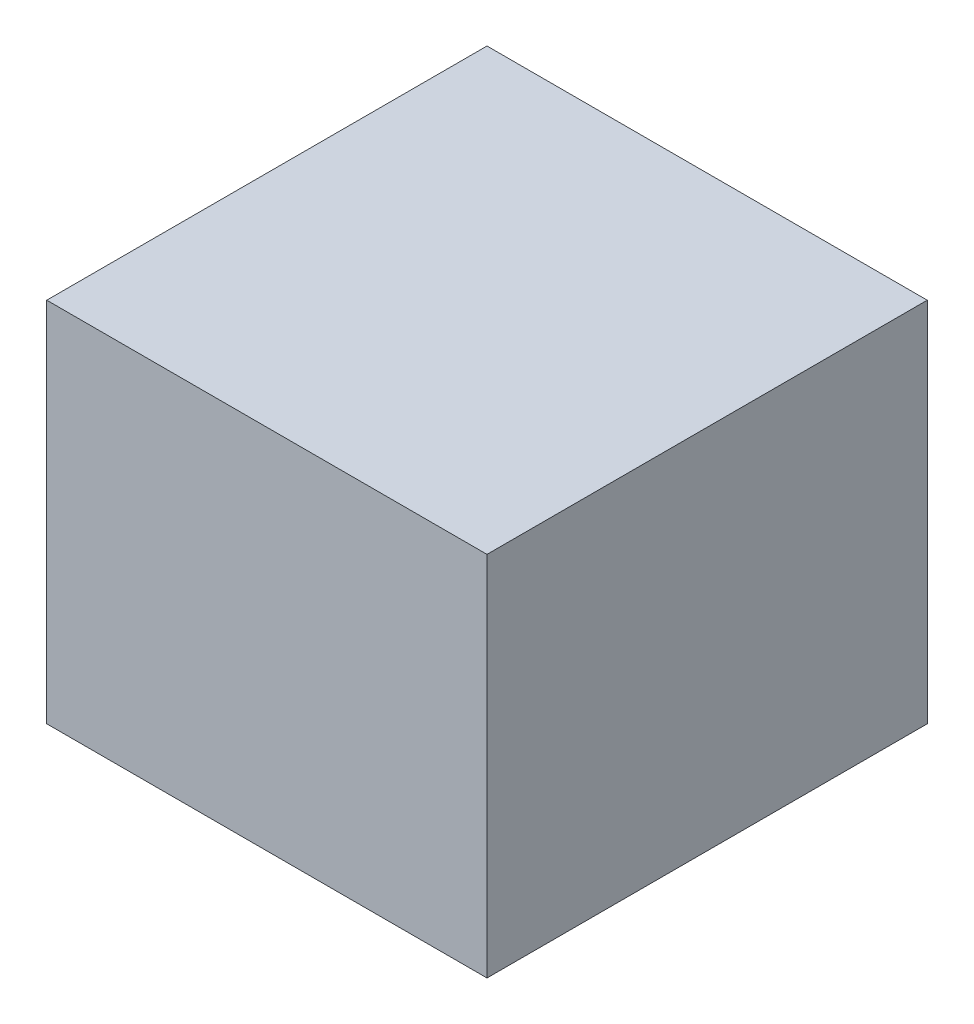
from build123d import *

# Parameters (mm, degrees)
SKETCH1_W      = 60
SKETCH1_H      = 60
EXTRUDE1_DEPTH = 50


with BuildPart() as part:
    # Sketch1 → Extrude1 (new body)
    with BuildSketch(Plane(origin=(0, 0, 0), x_dir=(-1, 0, 0), z_dir=(0, 1, 0))):
        Rectangle(SKETCH1_W, SKETCH1_H)
    extrude(amount=EXTRUDE1_DEPTH)


solid = part.part
